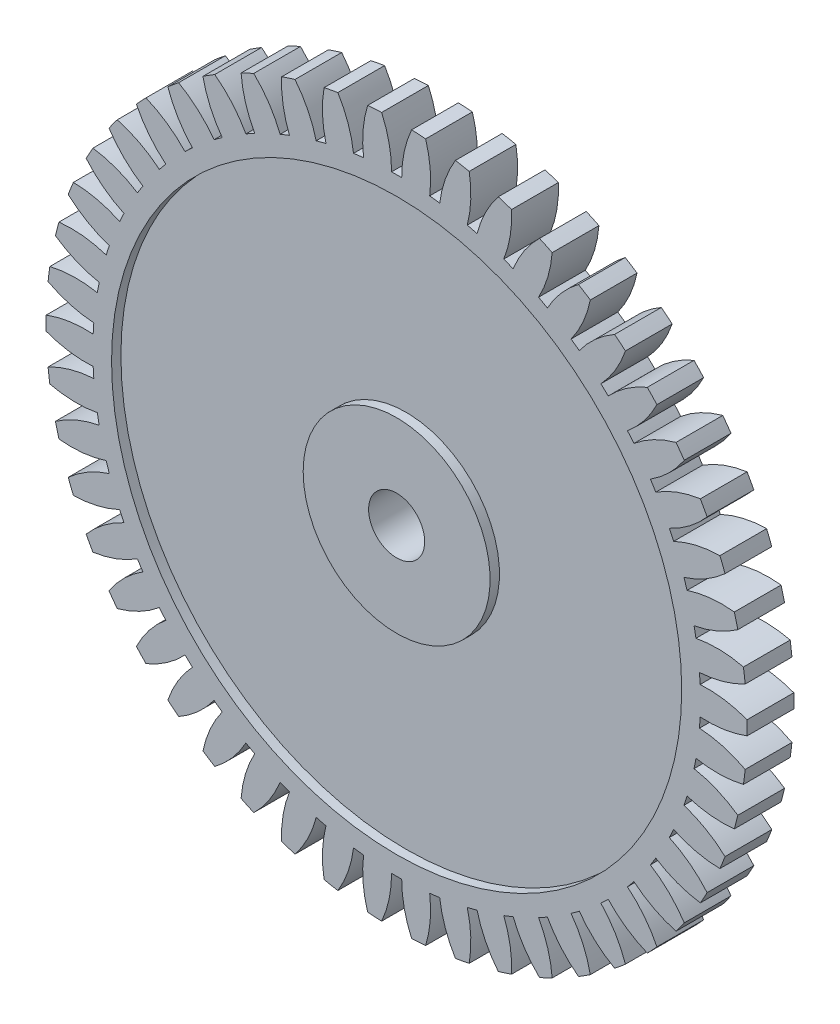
from build123d import *

# Parameters (mm, degrees)
SKETCH1_R          = 6.5
EXTRUDE1_DEPTH     = 0.5
EXTRUDE2_DEPTH     = 1
CIRPATTERN1_COUNT  = 50
SKETCH3_R          = 6.1
SKETCH3_R_2        = 2
CUT_EXTRUDE1_DEPTH = 0.2
EXTRUDE3_DEPTH     = 1.5
CIRPATTERN2_COUNT  = 14
SKETCH5_R          = 0.6
CUT_EXTRUDE2_DEPTH = 2.5


with BuildPart() as part:
    # Sketch1 → Extrude1 (new, symmetric)
    with BuildSketch(Plane.XY):
        Circle(SKETCH1_R)
    extrude(amount=EXTRUDE1_DEPTH, both=True)

    # Sketch2 → Extrude2 (add)
    with BuildSketch(Plane.XY.offset(0.5)):
        with BuildLine():
            ThreePointArc((-6.493073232, 0.3), (-6.5, 0), (-6.493073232, -0.3))
            ThreePointArc((-6.493073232, -0.3), (-7.003819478, -0.278843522), (-7.49849985, -0.15))
            ThreePointArc((-7.49849985, -0.15), (-7.5, 0), (-7.49849985, 0.15))
            ThreePointArc((-7.49849985, 0.15), (-7.003819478, 0.278843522), (-6.493073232, 0.3))
        make_face()
    extrude2 = extrude(amount=-EXTRUDE2_DEPTH)

    # CirPattern1: Extrude2 ×50 about axis
    cirpattern1_axis = Axis((0, 0, 0), (0, 0, 1))
    for i in range(1, CIRPATTERN1_COUNT):
        add(extrude2.rotate(cirpattern1_axis, i * 360 / CIRPATTERN1_COUNT))

    # Sketch3 → Cut-Extrude1 (cut)
    with BuildSketch(Plane(origin=(0, 0, -0.5), x_dir=(-1, 0, 0), z_dir=(0, 0, -1))):
        Circle(SKETCH3_R)
        Circle(SKETCH3_R_2, mode=Mode.SUBTRACT)
    cut_extrude1 = extrude(amount=-CUT_EXTRUDE1_DEPTH, mode=Mode.SUBTRACT)

    # Mirror1: Cut-Extrude1 across plane
    add(cut_extrude1.mirror(Plane.XY), mode=Mode.SUBTRACT)

    # Sketch4 → Extrude3 (add)
    with BuildSketch(Plane(origin=(0, 0, -0.5), x_dir=(-1, 0, 0), z_dir=(0, 0, -1))):
        with BuildLine():
            ThreePointArc((-0.2, 1.233896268), (-0.195395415, 1.529300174), (-0.073656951, 1.798492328))
            ThreePointArc((-0.073656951, 1.798492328), (0, 1.8), (0.073656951, 1.798492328))
            ThreePointArc((0.073656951, 1.798492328), (0.195395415, 1.529300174), (0.2, 1.233896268))
            ThreePointArc((0.2, 1.233896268), (0, -1.25), (-0.2, 1.233896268))
        make_face()
    extrude3 = extrude(amount=EXTRUDE3_DEPTH)

    # CirPattern2: Extrude3 ×14 about axis
    cirpattern2_axis = Axis((0, 0, 0), (0, 0, 1))
    for i in range(1, CIRPATTERN2_COUNT):
        add(extrude3.rotate(cirpattern2_axis, i * 360 / CIRPATTERN2_COUNT))

    # Sketch5 → Cut-Extrude2 (cut)
    with BuildSketch(Plane(origin=(0, 0, -2), x_dir=(-1, 0, 0), z_dir=(0, 0, -1))):
        Circle(SKETCH5_R)
    extrude(amount=-CUT_EXTRUDE2_DEPTH, mode=Mode.SUBTRACT)


solid = part.part
